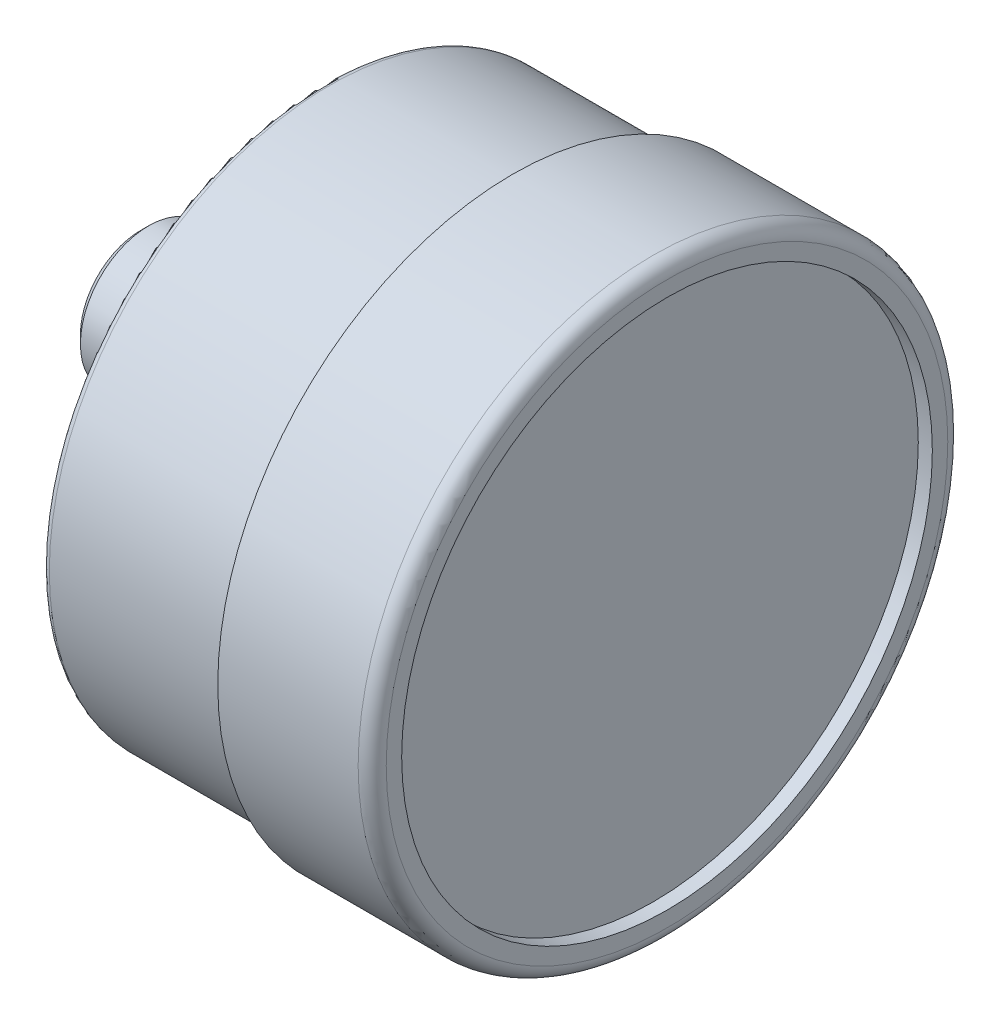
ISO-10303-21;
HEADER;
FILE_DESCRIPTION(('STEP AP214'),'2;1');
FILE_NAME('part.step','',(''),(''),'','','');
FILE_SCHEMA(('AUTOMOTIVE_DESIGN { 1 0 10303 214 1 1 1 1 }'));
ENDSEC;
DATA;
#1=APPLICATION_CONTEXT('core data for automotive mechanical design processes');
#2=APPLICATION_PROTOCOL_DEFINITION('international standard','automotive_design',2000,#1);
#3=PRODUCT_CONTEXT('',#1,'mechanical');
#4=PRODUCT('Part','Part','',(#3));
#5=PRODUCT_RELATED_PRODUCT_CATEGORY('part','',(#4));
#6=PRODUCT_DEFINITION_FORMATION('','',#4);
#7=PRODUCT_DEFINITION_CONTEXT('part definition',#1,'design');
#8=PRODUCT_DEFINITION('design','',#6,#7);
#9=PRODUCT_DEFINITION_SHAPE('','',#8);
#10=(LENGTH_UNIT() NAMED_UNIT(*) SI_UNIT(.MILLI.,.METRE.));
#11=(NAMED_UNIT(*) PLANE_ANGLE_UNIT() SI_UNIT($,.RADIAN.));
#12=(NAMED_UNIT(*) SI_UNIT($,.STERADIAN.) SOLID_ANGLE_UNIT());
#13=UNCERTAINTY_MEASURE_WITH_UNIT(LENGTH_MEASURE(1.E-05),#10,'distance_accuracy_value','');
#14=(GEOMETRIC_REPRESENTATION_CONTEXT(3) GLOBAL_UNCERTAINTY_ASSIGNED_CONTEXT((#13)) GLOBAL_UNIT_ASSIGNED_CONTEXT((#10,
#11,#12)) REPRESENTATION_CONTEXT('',''));
#15=CARTESIAN_POINT('',(0.,0.,0.));
#16=DIRECTION('',(0.,0.,1.));
#17=DIRECTION('',(1.,0.,0.));
#18=AXIS2_PLACEMENT_3D('',#15,#16,#17);
#19=CARTESIAN_POINT('',(0.,4.864,0.));
#20=DIRECTION('',(1.,0.,0.));
#21=DIRECTION('',(0.,0.,-1.));
#22=AXIS2_PLACEMENT_3D('',#19,#20,#21);
#23=PLANE('',#22);
#24=CARTESIAN_POINT('',(0.,0.,0.));
#25=DIRECTION('',(-1.,0.,0.));
#26=DIRECTION('',(0.,0.,1.));
#27=AXIS2_PLACEMENT_3D('',#24,#25,#26);
#28=CIRCLE('',#27,19.5);
#29=CARTESIAN_POINT('',(0.,0.,19.5));
#30=VERTEX_POINT('',#29);
#31=EDGE_CURVE('E177',#30,#30,#28,.T.);
#32=ORIENTED_EDGE('',*,*,#31,.T.);
#33=EDGE_LOOP('',(#32));
#34=FACE_BOUND('',#33,.T.);
#35=DIRECTION('',(0.,-1.,0.));
#36=VECTOR('',#35,1.);
#37=CARTESIAN_POINT('',(0.,4.864,4.864));
#38=LINE('',#37,#36);
#39=CARTESIAN_POINT('',(0.,4.864,4.864));
#40=VERTEX_POINT('',#39);
#41=CARTESIAN_POINT('',(0.,-4.864,4.864));
#42=VERTEX_POINT('',#41);
#43=EDGE_CURVE('E110',#40,#42,#38,.T.);
#44=ORIENTED_EDGE('',*,*,#43,.T.);
#45=DIRECTION('',(0.,0.,-1.));
#46=VECTOR('',#45,1.);
#47=CARTESIAN_POINT('',(0.,-4.864,4.864));
#48=LINE('',#47,#46);
#49=CARTESIAN_POINT('',(0.,-4.864,-4.864));
#50=VERTEX_POINT('',#49);
#51=EDGE_CURVE('E95',#42,#50,#48,.T.);
#52=ORIENTED_EDGE('',*,*,#51,.T.);
#53=DIRECTION('',(0.,1.,0.));
#54=VECTOR('',#53,1.);
#55=CARTESIAN_POINT('',(0.,-4.864,-4.864));
#56=LINE('',#55,#54);
#57=CARTESIAN_POINT('',(0.,4.864,-4.864));
#58=VERTEX_POINT('',#57);
#59=EDGE_CURVE('E107',#50,#58,#56,.T.);
#60=ORIENTED_EDGE('',*,*,#59,.T.);
#61=DIRECTION('',(0.,0.,1.));
#62=VECTOR('',#61,1.);
#63=CARTESIAN_POINT('',(0.,4.864,-4.864));
#64=LINE('',#63,#62);
#65=EDGE_CURVE('E114',#58,#40,#64,.T.);
#66=ORIENTED_EDGE('',*,*,#65,.T.);
#67=EDGE_LOOP('',(#44,#52,#60,#66));
#68=FACE_BOUND('',#67,.T.);
#69=ADVANCED_FACE('F39',(#34,#68),#23,.F.);
#70=CARTESIAN_POINT('',(0.500000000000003,0.,0.));
#71=DIRECTION('',(-1.,0.,0.));
#72=DIRECTION('',(0.,0.,1.));
#73=AXIS2_PLACEMENT_3D('',#70,#71,#72);
#74=TOROIDAL_SURFACE('',#73,19.5,0.500000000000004);
#75=ORIENTED_EDGE('',*,*,#31,.F.);
#76=EDGE_LOOP('',(#75));
#77=FACE_BOUND('',#76,.T.);
#78=CARTESIAN_POINT('',(0.5,0.,0.));
#79=DIRECTION('',(-1.,0.,0.));
#80=DIRECTION('',(0.,0.,1.));
#81=AXIS2_PLACEMENT_3D('',#78,#79,#80);
#82=CIRCLE('',#81,20.);
#83=CARTESIAN_POINT('',(0.5,0.,20.));
#84=VERTEX_POINT('',#83);
#85=EDGE_CURVE('E174',#84,#84,#82,.T.);
#86=ORIENTED_EDGE('',*,*,#85,.T.);
#87=EDGE_LOOP('',(#86));
#88=FACE_BOUND('',#87,.T.);
#89=ADVANCED_FACE('F214',(#77,#88),#74,.T.);
#90=CARTESIAN_POINT('',(23.5,0.,0.));
#91=DIRECTION('',(-1.,0.,0.));
#92=DIRECTION('',(0.,0.,1.));
#93=AXIS2_PLACEMENT_3D('',#90,#91,#92);
#94=CYLINDRICAL_SURFACE('',#93,20.);
#95=ORIENTED_EDGE('',*,*,#85,.F.);
#96=EDGE_LOOP('',(#95));
#97=FACE_BOUND('',#96,.T.);
#98=CARTESIAN_POINT('',(13.5,0.,0.));
#99=DIRECTION('',(-1.,0.,0.));
#100=DIRECTION('',(0.,0.,1.));
#101=AXIS2_PLACEMENT_3D('',#98,#99,#100);
#102=CIRCLE('',#101,20.);
#103=CARTESIAN_POINT('',(13.5,0.,20.));
#104=VERTEX_POINT('',#103);
#105=EDGE_CURVE('E171',#104,#104,#102,.T.);
#106=ORIENTED_EDGE('',*,*,#105,.T.);
#107=EDGE_LOOP('',(#106));
#108=FACE_BOUND('',#107,.T.);
#109=ADVANCED_FACE('F220',(#97,#108),#94,.T.);
#110=CARTESIAN_POINT('',(13.5,20.,0.));
#111=DIRECTION('',(1.,0.,0.));
#112=DIRECTION('',(0.,0.,-1.));
#113=AXIS2_PLACEMENT_3D('',#110,#111,#112);
#114=PLANE('',#113);
#115=ORIENTED_EDGE('',*,*,#105,.F.);
#116=EDGE_LOOP('',(#115));
#117=FACE_BOUND('',#116,.T.);
#118=CARTESIAN_POINT('',(13.5,0.,0.));
#119=DIRECTION('',(-1.,0.,0.));
#120=DIRECTION('',(0.,0.,1.));
#121=AXIS2_PLACEMENT_3D('',#118,#119,#120);
#122=CIRCLE('',#121,21.);
#123=CARTESIAN_POINT('',(13.5,0.,21.));
#124=VERTEX_POINT('',#123);
#125=EDGE_CURVE('E168',#124,#124,#122,.T.);
#126=ORIENTED_EDGE('',*,*,#125,.T.);
#127=EDGE_LOOP('',(#126));
#128=FACE_BOUND('',#127,.T.);
#129=ADVANCED_FACE('F298',(#117,#128),#114,.F.);
#130=CARTESIAN_POINT('',(23.5,0.,0.));
#131=DIRECTION('',(-1.,0.,0.));
#132=DIRECTION('',(0.,0.,1.));
#133=AXIS2_PLACEMENT_3D('',#130,#131,#132);
#134=CYLINDRICAL_SURFACE('',#133,21.);
#135=ORIENTED_EDGE('',*,*,#125,.F.);
#136=EDGE_LOOP('',(#135));
#137=FACE_BOUND('',#136,.T.);
#138=CARTESIAN_POINT('',(23.5,0.,0.));
#139=DIRECTION('',(-1.,0.,0.));
#140=DIRECTION('',(0.,0.,1.));
#141=AXIS2_PLACEMENT_3D('',#138,#139,#140);
#142=CIRCLE('',#141,21.);
#143=CARTESIAN_POINT('',(23.5,0.,21.));
#144=VERTEX_POINT('',#143);
#145=EDGE_CURVE('E165',#144,#144,#142,.T.);
#146=ORIENTED_EDGE('',*,*,#145,.T.);
#147=EDGE_LOOP('',(#146));
#148=FACE_BOUND('',#147,.T.);
#149=ADVANCED_FACE('F290',(#137,#148),#134,.T.);
#150=CARTESIAN_POINT('',(23.5,0.,0.));
#151=DIRECTION('',(-1.,0.,0.));
#152=DIRECTION('',(0.,0.,1.));
#153=AXIS2_PLACEMENT_3D('',#150,#151,#152);
#154=TOROIDAL_SURFACE('',#153,20.,1.00000000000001);
#155=ORIENTED_EDGE('',*,*,#145,.F.);
#156=EDGE_LOOP('',(#155));
#157=FACE_BOUND('',#156,.T.);
#158=CARTESIAN_POINT('',(24.5,0.,0.));
#159=DIRECTION('',(-1.,0.,0.));
#160=DIRECTION('',(0.,0.,1.));
#161=AXIS2_PLACEMENT_3D('',#158,#159,#160);
#162=CIRCLE('',#161,20.);
#163=CARTESIAN_POINT('',(24.5,0.,20.));
#164=VERTEX_POINT('',#163);
#165=EDGE_CURVE('E162',#164,#164,#162,.T.);
#166=ORIENTED_EDGE('',*,*,#165,.T.);
#167=EDGE_LOOP('',(#166));
#168=FACE_BOUND('',#167,.T.);
#169=ADVANCED_FACE('F281',(#157,#168),#154,.T.);
#170=CARTESIAN_POINT('',(24.5,20.,0.));
#171=DIRECTION('',(-1.,0.,0.));
#172=DIRECTION('',(0.,0.,1.));
#173=AXIS2_PLACEMENT_3D('',#170,#171,#172);
#174=PLANE('',#173);
#175=ORIENTED_EDGE('',*,*,#165,.F.);
#176=EDGE_LOOP('',(#175));
#177=FACE_BOUND('',#176,.T.);
#178=CARTESIAN_POINT('',(24.5,0.,0.));
#179=DIRECTION('',(-1.,0.,0.));
#180=DIRECTION('',(0.,0.,1.));
#181=AXIS2_PLACEMENT_3D('',#178,#179,#180);
#182=CIRCLE('',#181,18.9);
#183=CARTESIAN_POINT('',(24.5,0.,18.9));
#184=VERTEX_POINT('',#183);
#185=EDGE_CURVE('E159',#184,#184,#182,.T.);
#186=ORIENTED_EDGE('',*,*,#185,.T.);
#187=EDGE_LOOP('',(#186));
#188=FACE_BOUND('',#187,.T.);
#189=ADVANCED_FACE('F271',(#177,#188),#174,.F.);
#190=CARTESIAN_POINT('',(23.5,0.,0.));
#191=DIRECTION('',(-1.,0.,0.));
#192=DIRECTION('',(0.,0.,1.));
#193=AXIS2_PLACEMENT_3D('',#190,#191,#192);
#194=CYLINDRICAL_SURFACE('',#193,18.9);
#195=ORIENTED_EDGE('',*,*,#185,.F.);
#196=EDGE_LOOP('',(#195));
#197=FACE_BOUND('',#196,.T.);
#198=CARTESIAN_POINT('',(23.5,0.,0.));
#199=DIRECTION('',(-1.,0.,0.));
#200=DIRECTION('',(0.,0.,1.));
#201=AXIS2_PLACEMENT_3D('',#198,#199,#200);
#202=CIRCLE('',#201,18.9);
#203=CARTESIAN_POINT('',(23.5,0.,18.9));
#204=VERTEX_POINT('',#203);
#205=EDGE_CURVE('E156',#204,#204,#202,.T.);
#206=ORIENTED_EDGE('',*,*,#205,.T.);
#207=EDGE_LOOP('',(#206));
#208=FACE_BOUND('',#207,.T.);
#209=ADVANCED_FACE('F264',(#197,#208),#194,.F.);
#210=CARTESIAN_POINT('',(23.5,18.9,0.));
#211=DIRECTION('',(-1.,0.,0.));
#212=DIRECTION('',(0.,0.,1.));
#213=AXIS2_PLACEMENT_3D('',#210,#211,#212);
#214=PLANE('',#213);
#215=ORIENTED_EDGE('',*,*,#205,.F.);
#216=EDGE_LOOP('',(#215));
#217=FACE_BOUND('',#216,.T.);
#218=ADVANCED_FACE('F146',(#217),#214,.F.);
#219=CARTESIAN_POINT('',(-18.75,4.864,4.864));
#220=DIRECTION('',(0.,0.,1.));
#221=DIRECTION('',(1.,0.,0.));
#222=AXIS2_PLACEMENT_3D('',#219,#220,#221);
#223=PLANE('',#222);
#224=CARTESIAN_POINT('',(-6.50000000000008,0.,4.864));
#225=CARTESIAN_POINT('',(-6.50000229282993,-0.30646331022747,4.864));
#226=CARTESIAN_POINT('',(-6.48620933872,-0.61291934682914,4.864));
#227=CARTESIAN_POINT('',(-6.43192815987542,-1.2234422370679,4.864));
#228=CARTESIAN_POINT('',(-6.39143778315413,-1.52750889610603,4.864));
#229=CARTESIAN_POINT('',(-6.2857638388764,-2.13229253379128,4.864));
#230=CARTESIAN_POINT('',(-6.2204996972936,-2.43299525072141,4.864));
#231=CARTESIAN_POINT('',(-6.0678653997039,-3.02872195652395,4.864));
#232=CARTESIAN_POINT('',(-5.9804911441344,-3.32374488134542,4.864));
#233=CARTESIAN_POINT('',(-5.74553132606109,-4.02857535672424,4.864));
#234=CARTESIAN_POINT('',(-5.58801769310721,-4.43508626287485,4.864));
#235=CARTESIAN_POINT('',(-5.23859299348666,-5.23304949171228,4.864));
#236=CARTESIAN_POINT('',(-5.04666963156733,-5.62449637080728,4.864));
#237=CARTESIAN_POINT('',(-4.63204995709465,-6.39092012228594,4.864));
#238=CARTESIAN_POINT('',(-4.40933983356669,-6.76588950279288,4.864));
#239=CARTESIAN_POINT('',(-3.93604689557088,-7.49769020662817,4.864));
#240=CARTESIAN_POINT('',(-3.6854675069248,-7.85452375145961,4.864));
#241=CARTESIAN_POINT('',(-3.15214448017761,-8.55735451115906,4.864));
#242=CARTESIAN_POINT('',(-2.86875655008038,-8.90286245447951,4.864));
#243=CARTESIAN_POINT('',(-2.27722498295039,-9.57199999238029,4.864));
#244=CARTESIAN_POINT('',(-1.96908005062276,-9.8956284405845,4.864));
#245=CARTESIAN_POINT('',(-1.33016893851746,-10.5194956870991,4.864));
#246=CARTESIAN_POINT('',(-0.999410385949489,-10.8197422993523,4.864));
#247=CARTESIAN_POINT('',(-0.317263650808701,-11.3955523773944,4.864));
#248=CARTESIAN_POINT('',(0.0341181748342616,-11.671123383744,4.864));
#249=CARTESIAN_POINT('',(0.810688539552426,-12.2365294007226,4.864));
#250=CARTESIAN_POINT('',(1.23896382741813,-12.5221373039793,4.864));
#251=CARTESIAN_POINT('',(2.11745264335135,-13.0573920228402,4.864));
#252=CARTESIAN_POINT('',(2.56766820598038,-13.3070354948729,4.864));
#253=CARTESIAN_POINT('',(3.48720249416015,-13.7689770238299,4.864));
#254=CARTESIAN_POINT('',(3.95653234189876,-13.9812529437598,4.864));
#255=CARTESIAN_POINT('',(4.91087760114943,-14.3669864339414,4.864));
#256=CARTESIAN_POINT('',(5.39589315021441,-14.540443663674,4.864));
#257=CARTESIAN_POINT('',(6.39449652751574,-14.8525151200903,4.864));
#258=CARTESIAN_POINT('',(6.90849983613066,-14.989801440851,4.864));
#259=CARTESIAN_POINT('',(7.94618911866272,-15.2209435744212,4.864));
#260=CARTESIAN_POINT('',(8.46987535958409,-15.3147981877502,4.864));
#261=CARTESIAN_POINT('',(9.52321839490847,-15.4584545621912,4.864));
#262=CARTESIAN_POINT('',(10.0528747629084,-15.5082594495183,4.864));
#263=CARTESIAN_POINT('',(11.1144936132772,-15.563501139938,4.864));
#264=CARTESIAN_POINT('',(11.6464560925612,-15.5689380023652,4.864));
#265=CARTESIAN_POINT('',(12.7136248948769,-15.5352611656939,4.864));
#266=CARTESIAN_POINT('',(13.2488189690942,-15.495757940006,4.864));
#267=CARTESIAN_POINT('',(14.3139850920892,-15.3718305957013,4.864));
#268=CARTESIAN_POINT('',(14.8439570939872,-15.2874060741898,4.864));
#269=CARTESIAN_POINT('',(15.8949410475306,-15.0741904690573,4.864));
#270=CARTESIAN_POINT('',(16.4159523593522,-14.9453962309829,4.864));
#271=CARTESIAN_POINT('',(17.4452473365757,-14.6442988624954,4.864));
#272=CARTESIAN_POINT('',(17.9535310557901,-14.4719959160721,4.864));
#273=CARTESIAN_POINT('',(18.9535027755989,-14.0851025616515,4.864));
#274=CARTESIAN_POINT('',(19.4451975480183,-13.8705296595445,4.864));
#275=CARTESIAN_POINT('',(20.4086336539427,-13.400462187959,4.864));
#276=CARTESIAN_POINT('',(20.8803747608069,-13.1449671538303,4.864));
#277=CARTESIAN_POINT('',(21.800404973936,-12.5947239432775,4.864));
#278=CARTESIAN_POINT('',(22.2486933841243,-12.2999746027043,4.864));
#279=CARTESIAN_POINT('',(23.1183613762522,-11.6731456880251,4.864));
#280=CARTESIAN_POINT('',(23.5397419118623,-11.3410674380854,4.864));
#281=CARTESIAN_POINT('',(24.3479452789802,-10.6453890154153,4.864));
#282=CARTESIAN_POINT('',(24.7350838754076,-10.282155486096,4.864));
#283=CARTESIAN_POINT('',(25.4764308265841,-9.52341954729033,4.864));
#284=CARTESIAN_POINT('',(25.8306413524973,-9.12791926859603,4.864));
#285=CARTESIAN_POINT('',(26.3346615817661,-8.51226175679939,4.864));
#286=CARTESIAN_POINT('',(26.498186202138,-8.30320938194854,4.864));
#287=CARTESIAN_POINT('',(26.8156017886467,-7.8780004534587,4.864));
#288=CARTESIAN_POINT('',(26.9694949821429,-7.66184556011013,4.864));
#289=CARTESIAN_POINT('',(27.4159769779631,-7.00320155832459,4.864));
#290=CARTESIAN_POINT('',(27.6935431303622,-6.55032006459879,4.864));
#291=CARTESIAN_POINT('',(28.1230450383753,-5.76653844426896,4.864));
#292=CARTESIAN_POINT('',(28.2870112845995,-5.44215660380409,4.864));
#293=CARTESIAN_POINT('',(28.5916895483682,-4.78259191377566,4.864));
#294=CARTESIAN_POINT('',(28.7324033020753,-4.44740987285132,4.864));
#295=CARTESIAN_POINT('',(28.987493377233,-3.76823927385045,4.864));
#296=CARTESIAN_POINT('',(29.1019455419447,-3.42427934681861,4.864));
#297=CARTESIAN_POINT('',(29.3015100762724,-2.72790347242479,4.864));
#298=CARTESIAN_POINT('',(29.3866285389,-2.37548929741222,4.864));
#299=CARTESIAN_POINT('',(29.5122028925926,-1.72225304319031,4.864));
#300=CARTESIAN_POINT('',(29.5576813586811,-1.42240008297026,4.864));
#301=CARTESIAN_POINT('',(29.6229258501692,-0.819931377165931,4.864));
#302=CARTESIAN_POINT('',(29.6426985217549,-0.51731636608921,4.864));
#303=CARTESIAN_POINT('',(29.6553355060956,0.0883701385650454,4.864));
#304=CARTESIAN_POINT('',(29.6482101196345,0.391441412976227,4.864));
#305=CARTESIAN_POINT('',(29.6075303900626,0.995828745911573,4.864));
#306=CARTESIAN_POINT('',(29.5739701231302,1.2971443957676,4.864));
#307=CARTESIAN_POINT('',(29.472468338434,1.95999803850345,4.864));
#308=CARTESIAN_POINT('',(29.3987117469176,2.32064371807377,4.864));
#309=CARTESIAN_POINT('',(29.2193692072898,3.03390689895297,4.864));
#310=CARTESIAN_POINT('',(29.1137730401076,3.38652178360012,4.864));
#311=CARTESIAN_POINT('',(28.8743301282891,4.08338649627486,4.864));
#312=CARTESIAN_POINT('',(28.7403822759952,4.42760133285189,4.864));
#313=CARTESIAN_POINT('',(28.4476059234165,5.10520582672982,4.864));
#314=CARTESIAN_POINT('',(28.2887771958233,5.43859538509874,4.864));
#315=CARTESIAN_POINT('',(27.8943011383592,6.19819910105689,4.864));
#316=CARTESIAN_POINT('',(27.6503115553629,6.62009673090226,4.864));
#317=CARTESIAN_POINT('',(27.1271870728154,7.44154419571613,4.864));
#318=CARTESIAN_POINT('',(26.848043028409,7.84108817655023,4.864));
#319=CARTESIAN_POINT('',(26.2581794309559,8.61536230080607,4.864));
#320=CARTESIAN_POINT('',(25.9474980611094,8.99012156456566,4.864));
#321=CARTESIAN_POINT('',(25.2970402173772,9.71349692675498,4.864));
#322=CARTESIAN_POINT('',(24.957261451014,10.0621109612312,4.864));
#323=CARTESIAN_POINT('',(24.247672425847,10.7347443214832,4.864));
#324=CARTESIAN_POINT('',(23.8775949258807,11.0584816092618,4.864));
#325=CARTESIAN_POINT('',(23.1130288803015,11.675711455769,4.864));
#326=CARTESIAN_POINT('',(22.7185399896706,11.9692035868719,4.864));
#327=CARTESIAN_POINT('',(21.9076591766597,12.524427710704,4.864));
#328=CARTESIAN_POINT('',(21.4912613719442,12.7861511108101,4.864));
#329=CARTESIAN_POINT('',(20.6393225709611,13.2763133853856,4.864));
#330=CARTESIAN_POINT('',(20.2037813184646,13.5047518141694,4.864));
#331=CARTESIAN_POINT('',(19.2844476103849,13.9422206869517,4.864));
#332=CARTESIAN_POINT('',(18.7994336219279,14.1486888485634,4.864));
#333=CARTESIAN_POINT('',(17.8139231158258,14.5206381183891,4.864));
#334=CARTESIAN_POINT('',(17.3134258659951,14.686117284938,4.864));
#335=CARTESIAN_POINT('',(16.3003761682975,14.9750412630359,4.864));
#336=CARTESIAN_POINT('',(15.787822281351,15.0984810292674,4.864));
#337=CARTESIAN_POINT('',(14.7542601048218,15.3025051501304,4.864));
#338=CARTESIAN_POINT('',(14.2332518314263,15.3830895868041,4.864));
#339=CARTESIAN_POINT('',(13.1781778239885,15.501805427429,4.864));
#340=CARTESIAN_POINT('',(12.6440352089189,15.5392546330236,4.864));
#341=CARTESIAN_POINT('',(11.5744868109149,15.5691658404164,4.864));
#342=CARTESIAN_POINT('',(11.0390810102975,15.5616272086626,4.864));
#343=CARTESIAN_POINT('',(9.9707614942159,15.5016100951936,4.864));
#344=CARTESIAN_POINT('',(9.43784792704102,15.4491289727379,4.864));
#345=CARTESIAN_POINT('',(8.37831642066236,15.2995717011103,4.864));
#346=CARTESIAN_POINT('',(7.85169846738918,15.2024956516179,4.864));
#347=CARTESIAN_POINT('',(6.80697845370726,14.9640459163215,4.864));
#348=CARTESIAN_POINT('',(6.28890551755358,14.8225445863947,4.864));
#349=CARTESIAN_POINT('',(5.26656154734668,14.4962739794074,4.864));
#350=CARTESIAN_POINT('',(4.76229062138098,14.3115043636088,4.864));
#351=CARTESIAN_POINT('',(3.77122183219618,13.8999293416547,4.864));
#352=CARTESIAN_POINT('',(3.28442336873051,13.6731253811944,4.864));
#353=CARTESIAN_POINT('',(2.33186086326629,13.1789761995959,4.864));
#354=CARTESIAN_POINT('',(1.86609646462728,12.9116316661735,4.864));
#355=CARTESIAN_POINT('',(0.961532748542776,12.3396964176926,4.864));
#356=CARTESIAN_POINT('',(0.522601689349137,12.0353141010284,4.864));
#357=CARTESIAN_POINT('',(-0.327850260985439,11.3899608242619,4.864));
#358=CARTESIAN_POINT('',(-0.739357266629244,11.0489715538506,4.864));
#359=CARTESIAN_POINT('',(-1.53133470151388,10.3327250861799,4.864));
#360=CARTESIAN_POINT('',(-1.91180753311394,9.95747054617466,4.864));
#361=CARTESIAN_POINT('',(-2.63832902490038,9.17502226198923,4.864));
#362=CARTESIAN_POINT('',(-2.98438265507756,8.76783314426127,4.864));
#363=CARTESIAN_POINT('',(-3.57924101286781,8.00038944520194,4.864));
#364=CARTESIAN_POINT('',(-3.83431186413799,7.64497556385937,4.864));
#365=CARTESIAN_POINT('',(-4.3167208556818,6.91573053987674,4.864));
#366=CARTESIAN_POINT('',(-4.54405867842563,6.54189918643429,4.864));
#367=CARTESIAN_POINT('',(-4.96813215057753,5.77747866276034,4.864));
#368=CARTESIAN_POINT('',(-5.16488353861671,5.38689824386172,4.864));
#369=CARTESIAN_POINT('',(-5.52431279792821,4.5903415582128,4.864));
#370=CARTESIAN_POINT('',(-5.68700022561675,4.18436964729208,4.864));
#371=CARTESIAN_POINT('',(-5.93541667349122,3.46803814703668,4.864));
#372=CARTESIAN_POINT('',(-6.03012016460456,3.16078280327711,4.864));
#373=CARTESIAN_POINT('',(-6.19575264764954,2.5399054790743,4.864));
#374=CARTESIAN_POINT('',(-6.26668581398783,2.22628462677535,4.864));
#375=CARTESIAN_POINT('',(-6.38164784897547,1.59522367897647,4.864));
#376=CARTESIAN_POINT('',(-6.42577042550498,1.27780088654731,4.864));
#377=CARTESIAN_POINT('',(-6.48494301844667,0.640249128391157,4.864));
#378=CARTESIAN_POINT('',(-6.49999760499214,0.32012059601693,4.864));
#379=CARTESIAN_POINT('',(-6.50000000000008,0.,4.864));
#380=B_SPLINE_CURVE_WITH_KNOTS('',3,(#224,#225,#226,#227,#228,#229,#230,#231,#232,#233,#234,
#235,#236,#237,#238,#239,#240,#241,#242,#243,#244,#245,#246,#247,#248,#249,#250,#251,#252,#253,
#254,#255,#256,#257,#258,#259,#260,#261,#262,#263,#264,#265,#266,#267,#268,#269,#270,#271,#272,
#273,#274,#275,#276,#277,#278,#279,#280,#281,#282,#283,#284,#285,#286,#287,#288,#289,#290,#291,
#292,#293,#294,#295,#296,#297,#298,#299,#300,#301,#302,#303,#304,#305,#306,#307,#308,#309,#310,
#311,#312,#313,#314,#315,#316,#317,#318,#319,#320,#321,#322,#323,#324,#325,#326,#327,#328,#329,
#330,#331,#332,#333,#334,#335,#336,#337,#338,#339,#340,#341,#342,#343,#344,#345,#346,#347,#348,
#349,#350,#351,#352,#353,#354,#355,#356,#357,#358,#359,#360,#361,#362,#363,#364,#365,#366,#367,
#368,#369,#370,#371,#372,#373,#374,#375,#376,#377,#378,#379),.UNSPECIFIED.,.T.,.F.,(4,2,2,2,2,2,
2,2,2,2,2,2,2,2,2,2,2,2,2,2,2,2,2,2,2,2,2,2,2,2,2,2,2,2,2,2,2,2,2,2,2,2,2,2,2,2,2,2,2,2,2,2,2,2,
2,2,2,2,2,2,2,2,2,2,2,2,2,2,2,2,2,2,2,2,2,2,2,4),(0.,0.919080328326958,1.83823474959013,
2.76040459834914,3.68274555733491,4.98872078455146,6.29516359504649,7.6021943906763,
8.9090646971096,10.2483940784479,11.5877935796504,12.9267435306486,14.2652829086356,
15.8078271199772,17.3505146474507,18.8941130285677,20.4377249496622,22.0319153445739,
23.6261497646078,25.2202710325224,26.8143901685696,28.422432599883,30.0304894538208,
31.6386606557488,33.2468250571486,34.8543248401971,36.4618428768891,38.0694085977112,
39.6769173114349,41.2675867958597,42.8581513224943,43.6541471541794,44.4499582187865,
46.0407562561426,47.1304017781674,48.2199659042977,49.3063426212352,50.3924935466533,
51.3013390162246,52.2099494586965,53.1182119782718,54.0266780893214,55.1293024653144,
56.2322811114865,57.3392615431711,58.4462520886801,59.9063866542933,61.3669018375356,
62.8256693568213,64.2845519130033,65.75808009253,67.2316291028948,68.7055757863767,
70.179542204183,71.7590889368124,73.3387104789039,74.9185215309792,76.4983295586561,
78.1027938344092,79.7072807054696,81.3118618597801,82.916439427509,84.5256701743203,
86.1349135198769,87.7441015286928,89.35326224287,90.9537546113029,92.5550512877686,
94.1562238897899,95.757164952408,97.0684005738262,98.3796512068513,99.6902248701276,
101.000430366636,101.964176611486,102.927753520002,103.887942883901,104.847981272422),.UNSPECIFIED.);
#381=CARTESIAN_POINT('',(-6.49999999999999,0.,4.864));
#382=VERTEX_POINT('',#381);
#383=CARTESIAN_POINT('',(-5.40015962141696,-4.864,4.86400000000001));
#384=VERTEX_POINT('',#383);
#385=EDGE_CURVE('E151',#382,#384,#380,.T.);
#386=ORIENTED_EDGE('',*,*,#385,.T.);
#387=DIRECTION('',(1.,0.,0.));
#388=VECTOR('',#387,1.);
#389=CARTESIAN_POINT('',(-18.75,-4.864,4.864));
#390=LINE('',#389,#388);
#391=EDGE_CURVE('E55',#384,#42,#390,.T.);
#392=ORIENTED_EDGE('',*,*,#391,.T.);
#393=ORIENTED_EDGE('',*,*,#43,.F.);
#394=DIRECTION('',(1.,0.,0.));
#395=VECTOR('',#394,1.);
#396=CARTESIAN_POINT('',(-18.75,4.864,4.864));
#397=LINE('',#396,#395);
#398=CARTESIAN_POINT('',(-5.40015962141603,4.864,4.864));
#399=VERTEX_POINT('',#398);
#400=EDGE_CURVE('E119',#399,#40,#397,.T.);
#401=ORIENTED_EDGE('',*,*,#400,.F.);
#402=EDGE_CURVE('E62',#399,#382,#380,.T.);
#403=ORIENTED_EDGE('',*,*,#402,.T.);
#404=EDGE_LOOP('',(#386,#392,#393,#401,#403));
#405=FACE_BOUND('',#404,.T.);
#406=ADVANCED_FACE('F142',(#405),#223,.T.);
#407=CARTESIAN_POINT('',(-18.75,4.864,-4.864));
#408=DIRECTION('',(0.,1.,0.));
#409=DIRECTION('',(0.,0.,1.));
#410=AXIS2_PLACEMENT_3D('',#407,#408,#409);
#411=PLANE('',#410);
#412=CARTESIAN_POINT('',(-6.50000000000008,4.864,0.));
#413=CARTESIAN_POINT('',(-6.50000229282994,4.864,0.30646331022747));
#414=CARTESIAN_POINT('',(-6.48620933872,4.864,0.61291934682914));
#415=CARTESIAN_POINT('',(-6.43192815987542,4.864,1.2234422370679));
#416=CARTESIAN_POINT('',(-6.39143778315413,4.864,1.52750889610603));
#417=CARTESIAN_POINT('',(-6.2857638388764,4.864,2.13229253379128));
#418=CARTESIAN_POINT('',(-6.2204996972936,4.864,2.43299525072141));
#419=CARTESIAN_POINT('',(-6.0678653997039,4.864,3.02872195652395));
#420=CARTESIAN_POINT('',(-5.9804911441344,4.864,3.32374488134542));
#421=CARTESIAN_POINT('',(-5.74553132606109,4.864,4.02857535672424));
#422=CARTESIAN_POINT('',(-5.58801769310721,4.864,4.43508626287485));
#423=CARTESIAN_POINT('',(-5.23859299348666,4.864,5.23304949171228));
#424=CARTESIAN_POINT('',(-5.04666963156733,4.864,5.62449637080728));
#425=CARTESIAN_POINT('',(-4.63204995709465,4.864,6.39092012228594));
#426=CARTESIAN_POINT('',(-4.40933983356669,4.864,6.76588950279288));
#427=CARTESIAN_POINT('',(-3.93604689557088,4.864,7.49769020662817));
#428=CARTESIAN_POINT('',(-3.6854675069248,4.864,7.85452375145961));
#429=CARTESIAN_POINT('',(-3.15214448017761,4.864,8.55735451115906));
#430=CARTESIAN_POINT('',(-2.86875655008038,4.864,8.90286245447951));
#431=CARTESIAN_POINT('',(-2.27722498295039,4.864,9.57199999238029));
#432=CARTESIAN_POINT('',(-1.96908005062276,4.864,9.8956284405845));
#433=CARTESIAN_POINT('',(-1.33016893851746,4.864,10.5194956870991));
#434=CARTESIAN_POINT('',(-0.999410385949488,4.864,10.8197422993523));
#435=CARTESIAN_POINT('',(-0.317263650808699,4.864,11.3955523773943));
#436=CARTESIAN_POINT('',(0.0341181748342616,4.864,11.671123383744));
#437=CARTESIAN_POINT('',(0.810688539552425,4.864,12.2365294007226));
#438=CARTESIAN_POINT('',(1.23896382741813,4.864,12.5221373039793));
#439=CARTESIAN_POINT('',(2.11745264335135,4.864,13.0573920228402));
#440=CARTESIAN_POINT('',(2.56766820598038,4.864,13.3070354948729));
#441=CARTESIAN_POINT('',(3.48720249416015,4.864,13.7689770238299));
#442=CARTESIAN_POINT('',(3.95653234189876,4.864,13.9812529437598));
#443=CARTESIAN_POINT('',(4.91087760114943,4.864,14.3669864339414));
#444=CARTESIAN_POINT('',(5.39589315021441,4.864,14.540443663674));
#445=CARTESIAN_POINT('',(6.39449652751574,4.864,14.8525151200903));
#446=CARTESIAN_POINT('',(6.90849983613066,4.864,14.989801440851));
#447=CARTESIAN_POINT('',(7.94618911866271,4.864,15.2209435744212));
#448=CARTESIAN_POINT('',(8.46987535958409,4.864,15.3147981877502));
#449=CARTESIAN_POINT('',(9.52321839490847,4.864,15.4584545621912));
#450=CARTESIAN_POINT('',(10.0528747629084,4.864,15.5082594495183));
#451=CARTESIAN_POINT('',(11.1144936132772,4.864,15.563501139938));
#452=CARTESIAN_POINT('',(11.6464560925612,4.864,15.5689380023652));
#453=CARTESIAN_POINT('',(12.7136248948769,4.864,15.5352611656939));
#454=CARTESIAN_POINT('',(13.2488189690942,4.864,15.495757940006));
#455=CARTESIAN_POINT('',(14.3139850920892,4.864,15.3718305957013));
#456=CARTESIAN_POINT('',(14.8439570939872,4.864,15.2874060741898));
#457=CARTESIAN_POINT('',(15.8949410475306,4.864,15.0741904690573));
#458=CARTESIAN_POINT('',(16.4159523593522,4.864,14.9453962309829));
#459=CARTESIAN_POINT('',(17.4452473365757,4.864,14.6442988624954));
#460=CARTESIAN_POINT('',(17.9535310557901,4.864,14.4719959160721));
#461=CARTESIAN_POINT('',(18.9535027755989,4.864,14.0851025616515));
#462=CARTESIAN_POINT('',(19.4451975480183,4.864,13.8705296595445));
#463=CARTESIAN_POINT('',(20.4086336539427,4.864,13.400462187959));
#464=CARTESIAN_POINT('',(20.8803747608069,4.864,13.1449671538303));
#465=CARTESIAN_POINT('',(21.800404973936,4.864,12.5947239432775));
#466=CARTESIAN_POINT('',(22.2486933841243,4.864,12.2999746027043));
#467=CARTESIAN_POINT('',(23.1183613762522,4.864,11.6731456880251));
#468=CARTESIAN_POINT('',(23.5397419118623,4.864,11.3410674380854));
#469=CARTESIAN_POINT('',(24.3479452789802,4.864,10.6453890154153));
#470=CARTESIAN_POINT('',(24.7350838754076,4.864,10.282155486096));
#471=CARTESIAN_POINT('',(25.4764308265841,4.864,9.52341954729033));
#472=CARTESIAN_POINT('',(25.8306413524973,4.864,9.12791926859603));
#473=CARTESIAN_POINT('',(26.3346615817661,4.864,8.51226175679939));
#474=CARTESIAN_POINT('',(26.498186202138,4.864,8.30320938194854));
#475=CARTESIAN_POINT('',(26.8156017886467,4.864,7.8780004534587));
#476=CARTESIAN_POINT('',(26.9694949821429,4.864,7.66184556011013));
#477=CARTESIAN_POINT('',(27.4159769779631,4.864,7.00320155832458));
#478=CARTESIAN_POINT('',(27.6935431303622,4.864,6.55032006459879));
#479=CARTESIAN_POINT('',(28.1230450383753,4.864,5.76653844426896));
#480=CARTESIAN_POINT('',(28.2870112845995,4.864,5.44215660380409));
#481=CARTESIAN_POINT('',(28.5916895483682,4.864,4.78259191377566));
#482=CARTESIAN_POINT('',(28.7324033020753,4.864,4.44740987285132));
#483=CARTESIAN_POINT('',(28.987493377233,4.864,3.76823927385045));
#484=CARTESIAN_POINT('',(29.1019455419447,4.864,3.42427934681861));
#485=CARTESIAN_POINT('',(29.3015100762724,4.864,2.72790347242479));
#486=CARTESIAN_POINT('',(29.3866285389,4.864,2.37548929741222));
#487=CARTESIAN_POINT('',(29.5122028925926,4.864,1.72225304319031));
#488=CARTESIAN_POINT('',(29.5576813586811,4.864,1.42240008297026));
#489=CARTESIAN_POINT('',(29.6229258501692,4.864,0.819931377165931));
#490=CARTESIAN_POINT('',(29.6426985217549,4.864,0.51731636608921));
#491=CARTESIAN_POINT('',(29.6553355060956,4.864,-0.0883701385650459));
#492=CARTESIAN_POINT('',(29.6482101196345,4.864,-0.391441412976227));
#493=CARTESIAN_POINT('',(29.6075303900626,4.864,-0.995828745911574));
#494=CARTESIAN_POINT('',(29.5739701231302,4.864,-1.2971443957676));
#495=CARTESIAN_POINT('',(29.472468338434,4.864,-1.95999803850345));
#496=CARTESIAN_POINT('',(29.3987117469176,4.864,-2.32064371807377));
#497=CARTESIAN_POINT('',(29.2193692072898,4.864,-3.03390689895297));
#498=CARTESIAN_POINT('',(29.1137730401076,4.864,-3.38652178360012));
#499=CARTESIAN_POINT('',(28.8743301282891,4.864,-4.08338649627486));
#500=CARTESIAN_POINT('',(28.7403822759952,4.864,-4.42760133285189));
#501=CARTESIAN_POINT('',(28.4476059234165,4.864,-5.10520582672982));
#502=CARTESIAN_POINT('',(28.2887771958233,4.864,-5.43859538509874));
#503=CARTESIAN_POINT('',(27.8943011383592,4.864,-6.19819910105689));
#504=CARTESIAN_POINT('',(27.6503115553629,4.864,-6.62009673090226));
#505=CARTESIAN_POINT('',(27.1271870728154,4.864,-7.44154419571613));
#506=CARTESIAN_POINT('',(26.848043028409,4.864,-7.84108817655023));
#507=CARTESIAN_POINT('',(26.2581794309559,4.864,-8.61536230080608));
#508=CARTESIAN_POINT('',(25.9474980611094,4.864,-8.99012156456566));
#509=CARTESIAN_POINT('',(25.2970402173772,4.864,-9.71349692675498));
#510=CARTESIAN_POINT('',(24.957261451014,4.864,-10.0621109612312));
#511=CARTESIAN_POINT('',(24.247672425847,4.864,-10.7347443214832));
#512=CARTESIAN_POINT('',(23.8775949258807,4.864,-11.0584816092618));
#513=CARTESIAN_POINT('',(23.1130288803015,4.864,-11.675711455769));
#514=CARTESIAN_POINT('',(22.7185399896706,4.864,-11.9692035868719));
#515=CARTESIAN_POINT('',(21.9076591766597,4.864,-12.524427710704));
#516=CARTESIAN_POINT('',(21.4912613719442,4.864,-12.7861511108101));
#517=CARTESIAN_POINT('',(20.6393225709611,4.864,-13.2763133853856));
#518=CARTESIAN_POINT('',(20.2037813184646,4.864,-13.5047518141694));
#519=CARTESIAN_POINT('',(19.2844476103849,4.864,-13.9422206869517));
#520=CARTESIAN_POINT('',(18.7994336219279,4.864,-14.1486888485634));
#521=CARTESIAN_POINT('',(17.8139231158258,4.864,-14.5206381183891));
#522=CARTESIAN_POINT('',(17.3134258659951,4.864,-14.6861172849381));
#523=CARTESIAN_POINT('',(16.3003761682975,4.864,-14.9750412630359));
#524=CARTESIAN_POINT('',(15.7878222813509,4.864,-15.0984810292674));
#525=CARTESIAN_POINT('',(14.7542601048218,4.864,-15.3025051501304));
#526=CARTESIAN_POINT('',(14.2332518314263,4.864,-15.3830895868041));
#527=CARTESIAN_POINT('',(13.1781778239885,4.864,-15.501805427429));
#528=CARTESIAN_POINT('',(12.6440352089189,4.864,-15.5392546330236));
#529=CARTESIAN_POINT('',(11.5744868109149,4.864,-15.5691658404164));
#530=CARTESIAN_POINT('',(11.0390810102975,4.864,-15.5616272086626));
#531=CARTESIAN_POINT('',(9.9707614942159,4.864,-15.5016100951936));
#532=CARTESIAN_POINT('',(9.43784792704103,4.864,-15.4491289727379));
#533=CARTESIAN_POINT('',(8.37831642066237,4.864,-15.2995717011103));
#534=CARTESIAN_POINT('',(7.85169846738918,4.864,-15.2024956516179));
#535=CARTESIAN_POINT('',(6.80697845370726,4.864,-14.9640459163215));
#536=CARTESIAN_POINT('',(6.28890551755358,4.864,-14.8225445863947));
#537=CARTESIAN_POINT('',(5.26656154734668,4.864,-14.4962739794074));
#538=CARTESIAN_POINT('',(4.76229062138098,4.864,-14.3115043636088));
#539=CARTESIAN_POINT('',(3.77122183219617,4.864,-13.8999293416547));
#540=CARTESIAN_POINT('',(3.28442336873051,4.864,-13.6731253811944));
#541=CARTESIAN_POINT('',(2.3318608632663,4.864,-13.1789761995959));
#542=CARTESIAN_POINT('',(1.86609646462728,4.864,-12.9116316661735));
#543=CARTESIAN_POINT('',(0.961532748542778,4.864,-12.3396964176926));
#544=CARTESIAN_POINT('',(0.52260168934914,4.864,-12.0353141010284));
#545=CARTESIAN_POINT('',(-0.327850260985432,4.864,-11.389960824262));
#546=CARTESIAN_POINT('',(-0.739357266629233,4.864,-11.0489715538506));
#547=CARTESIAN_POINT('',(-1.53133470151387,4.864,-10.3327250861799));
#548=CARTESIAN_POINT('',(-1.91180753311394,4.864,-9.95747054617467));
#549=CARTESIAN_POINT('',(-2.63832902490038,4.864,-9.17502226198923));
#550=CARTESIAN_POINT('',(-2.98438265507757,4.864,-8.76783314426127));
#551=CARTESIAN_POINT('',(-3.57924101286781,4.864,-8.00038944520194));
#552=CARTESIAN_POINT('',(-3.83431186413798,4.864,-7.64497556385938));
#553=CARTESIAN_POINT('',(-4.31672085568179,4.864,-6.91573053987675));
#554=CARTESIAN_POINT('',(-4.54405867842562,4.864,-6.54189918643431));
#555=CARTESIAN_POINT('',(-4.96813215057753,4.864,-5.77747866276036));
#556=CARTESIAN_POINT('',(-5.16488353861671,4.864,-5.38689824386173));
#557=CARTESIAN_POINT('',(-5.52431279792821,4.864,-4.5903415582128));
#558=CARTESIAN_POINT('',(-5.68700022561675,4.864,-4.18436964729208));
#559=CARTESIAN_POINT('',(-5.93541667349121,4.864,-3.46803814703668));
#560=CARTESIAN_POINT('',(-6.03012016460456,4.864,-3.1607828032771));
#561=CARTESIAN_POINT('',(-6.19575264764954,4.864,-2.53990547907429));
#562=CARTESIAN_POINT('',(-6.26668581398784,4.864,-2.22628462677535));
#563=CARTESIAN_POINT('',(-6.38164784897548,4.864,-1.59522367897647));
#564=CARTESIAN_POINT('',(-6.42577042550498,4.864,-1.27780088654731));
#565=CARTESIAN_POINT('',(-6.48494301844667,4.864,-0.640249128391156));
#566=CARTESIAN_POINT('',(-6.49999760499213,4.864,-0.32012059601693));
#567=CARTESIAN_POINT('',(-6.50000000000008,4.864,0.));
#568=B_SPLINE_CURVE_WITH_KNOTS('',3,(#412,#413,#414,#415,#416,#417,#418,#419,#420,#421,#422,
#423,#424,#425,#426,#427,#428,#429,#430,#431,#432,#433,#434,#435,#436,#437,#438,#439,#440,#441,
#442,#443,#444,#445,#446,#447,#448,#449,#450,#451,#452,#453,#454,#455,#456,#457,#458,#459,#460,
#461,#462,#463,#464,#465,#466,#467,#468,#469,#470,#471,#472,#473,#474,#475,#476,#477,#478,#479,
#480,#481,#482,#483,#484,#485,#486,#487,#488,#489,#490,#491,#492,#493,#494,#495,#496,#497,#498,
#499,#500,#501,#502,#503,#504,#505,#506,#507,#508,#509,#510,#511,#512,#513,#514,#515,#516,#517,
#518,#519,#520,#521,#522,#523,#524,#525,#526,#527,#528,#529,#530,#531,#532,#533,#534,#535,#536,
#537,#538,#539,#540,#541,#542,#543,#544,#545,#546,#547,#548,#549,#550,#551,#552,#553,#554,#555,
#556,#557,#558,#559,#560,#561,#562,#563,#564,#565,#566,#567),.UNSPECIFIED.,.T.,.F.,(4,2,2,2,2,2,
2,2,2,2,2,2,2,2,2,2,2,2,2,2,2,2,2,2,2,2,2,2,2,2,2,2,2,2,2,2,2,2,2,2,2,2,2,2,2,2,2,2,2,2,2,2,2,2,
2,2,2,2,2,2,2,2,2,2,2,2,2,2,2,2,2,2,2,2,2,2,2,4),(0.,0.919080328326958,1.83823474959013,
2.76040459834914,3.68274555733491,4.98872078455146,6.29516359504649,7.6021943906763,
8.9090646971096,10.2483940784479,11.5877935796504,12.9267435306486,14.2652829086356,
15.8078271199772,17.3505146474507,18.8941130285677,20.4377249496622,22.0319153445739,
23.6261497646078,25.2202710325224,26.8143901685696,28.422432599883,30.0304894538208,
31.6386606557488,33.2468250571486,34.8543248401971,36.4618428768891,38.0694085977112,
39.6769173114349,41.2675867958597,42.8581513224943,43.6541471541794,44.4499582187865,
46.0407562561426,47.1304017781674,48.2199659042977,49.3063426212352,50.3924935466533,
51.3013390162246,52.2099494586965,53.1182119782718,54.0266780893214,55.1293024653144,
56.2322811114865,57.3392615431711,58.4462520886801,59.9063866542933,61.3669018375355,
62.8256693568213,64.2845519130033,65.7580800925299,67.2316291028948,68.7055757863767,
70.1795422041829,71.7590889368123,73.3387104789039,74.9185215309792,76.498329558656,
78.1027938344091,79.7072807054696,81.3118618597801,82.9164394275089,84.5256701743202,
86.1349135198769,87.7441015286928,89.35326224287,90.9537546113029,92.5550512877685,
94.1562238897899,95.757164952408,97.0684005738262,98.3796512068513,99.6902248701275,
101.000430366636,101.964176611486,102.927753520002,103.887942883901,104.847981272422),.UNSPECIFIED.);
#569=CARTESIAN_POINT('',(-6.49999999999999,4.864,0.));
#570=VERTEX_POINT('',#569);
#571=EDGE_CURVE('E152',#570,#399,#568,.T.);
#572=ORIENTED_EDGE('',*,*,#571,.T.);
#573=ORIENTED_EDGE('',*,*,#400,.T.);
#574=ORIENTED_EDGE('',*,*,#65,.F.);
#575=DIRECTION('',(1.,0.,0.));
#576=VECTOR('',#575,1.);
#577=CARTESIAN_POINT('',(-18.75,4.864,-4.864));
#578=LINE('',#577,#576);
#579=CARTESIAN_POINT('',(-5.40015962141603,4.864,-4.864));
#580=VERTEX_POINT('',#579);
#581=EDGE_CURVE('E101',#580,#58,#578,.T.);
#582=ORIENTED_EDGE('',*,*,#581,.F.);
#583=EDGE_CURVE('E153',#580,#570,#568,.T.);
#584=ORIENTED_EDGE('',*,*,#583,.T.);
#585=EDGE_LOOP('',(#572,#573,#574,#582,#584));
#586=FACE_BOUND('',#585,.T.);
#587=ADVANCED_FACE('F145',(#586),#411,.T.);
#588=CARTESIAN_POINT('',(-18.75,-4.864,-4.864));
#589=DIRECTION('',(0.,0.,-1.));
#590=DIRECTION('',(-1.,0.,0.));
#591=AXIS2_PLACEMENT_3D('',#588,#589,#590);
#592=PLANE('',#591);
#593=CARTESIAN_POINT('',(-6.50000000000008,0.,-4.864));
#594=CARTESIAN_POINT('',(-6.50000229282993,0.30646331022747,-4.864));
#595=CARTESIAN_POINT('',(-6.48620933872,0.61291934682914,-4.864));
#596=CARTESIAN_POINT('',(-6.43192815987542,1.2234422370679,-4.864));
#597=CARTESIAN_POINT('',(-6.39143778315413,1.52750889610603,-4.864));
#598=CARTESIAN_POINT('',(-6.2857638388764,2.13229253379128,-4.864));
#599=CARTESIAN_POINT('',(-6.2204996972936,2.43299525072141,-4.864));
#600=CARTESIAN_POINT('',(-6.0678653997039,3.02872195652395,-4.864));
#601=CARTESIAN_POINT('',(-5.9804911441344,3.32374488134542,-4.864));
#602=CARTESIAN_POINT('',(-5.74553132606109,4.02857535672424,-4.864));
#603=CARTESIAN_POINT('',(-5.58801769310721,4.43508626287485,-4.864));
#604=CARTESIAN_POINT('',(-5.23859299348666,5.23304949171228,-4.864));
#605=CARTESIAN_POINT('',(-5.04666963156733,5.62449637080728,-4.864));
#606=CARTESIAN_POINT('',(-4.63204995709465,6.39092012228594,-4.864));
#607=CARTESIAN_POINT('',(-4.40933983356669,6.76588950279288,-4.864));
#608=CARTESIAN_POINT('',(-3.93604689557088,7.49769020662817,-4.864));
#609=CARTESIAN_POINT('',(-3.6854675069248,7.85452375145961,-4.864));
#610=CARTESIAN_POINT('',(-3.15214448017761,8.55735451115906,-4.864));
#611=CARTESIAN_POINT('',(-2.86875655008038,8.90286245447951,-4.864));
#612=CARTESIAN_POINT('',(-2.27722498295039,9.57199999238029,-4.864));
#613=CARTESIAN_POINT('',(-1.96908005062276,9.8956284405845,-4.864));
#614=CARTESIAN_POINT('',(-1.33016893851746,10.5194956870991,-4.864));
#615=CARTESIAN_POINT('',(-0.999410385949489,10.8197422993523,-4.864));
#616=CARTESIAN_POINT('',(-0.317263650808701,11.3955523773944,-4.864));
#617=CARTESIAN_POINT('',(0.0341181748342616,11.671123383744,-4.864));
#618=CARTESIAN_POINT('',(0.810688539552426,12.2365294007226,-4.864));
#619=CARTESIAN_POINT('',(1.23896382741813,12.5221373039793,-4.864));
#620=CARTESIAN_POINT('',(2.11745264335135,13.0573920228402,-4.864));
#621=CARTESIAN_POINT('',(2.56766820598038,13.3070354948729,-4.864));
#622=CARTESIAN_POINT('',(3.48720249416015,13.7689770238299,-4.864));
#623=CARTESIAN_POINT('',(3.95653234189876,13.9812529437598,-4.864));
#624=CARTESIAN_POINT('',(4.91087760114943,14.3669864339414,-4.864));
#625=CARTESIAN_POINT('',(5.39589315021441,14.540443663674,-4.864));
#626=CARTESIAN_POINT('',(6.39449652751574,14.8525151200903,-4.864));
#627=CARTESIAN_POINT('',(6.90849983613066,14.989801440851,-4.864));
#628=CARTESIAN_POINT('',(7.94618911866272,15.2209435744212,-4.864));
#629=CARTESIAN_POINT('',(8.46987535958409,15.3147981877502,-4.864));
#630=CARTESIAN_POINT('',(9.52321839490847,15.4584545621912,-4.864));
#631=CARTESIAN_POINT('',(10.0528747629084,15.5082594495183,-4.864));
#632=CARTESIAN_POINT('',(11.1144936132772,15.563501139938,-4.864));
#633=CARTESIAN_POINT('',(11.6464560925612,15.5689380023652,-4.864));
#634=CARTESIAN_POINT('',(12.7136248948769,15.5352611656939,-4.864));
#635=CARTESIAN_POINT('',(13.2488189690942,15.495757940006,-4.864));
#636=CARTESIAN_POINT('',(14.3139850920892,15.3718305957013,-4.864));
#637=CARTESIAN_POINT('',(14.8439570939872,15.2874060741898,-4.864));
#638=CARTESIAN_POINT('',(15.8949410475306,15.0741904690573,-4.864));
#639=CARTESIAN_POINT('',(16.4159523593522,14.9453962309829,-4.864));
#640=CARTESIAN_POINT('',(17.4452473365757,14.6442988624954,-4.864));
#641=CARTESIAN_POINT('',(17.9535310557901,14.4719959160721,-4.864));
#642=CARTESIAN_POINT('',(18.9535027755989,14.0851025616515,-4.864));
#643=CARTESIAN_POINT('',(19.4451975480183,13.8705296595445,-4.864));
#644=CARTESIAN_POINT('',(20.4086336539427,13.400462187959,-4.864));
#645=CARTESIAN_POINT('',(20.8803747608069,13.1449671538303,-4.864));
#646=CARTESIAN_POINT('',(21.800404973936,12.5947239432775,-4.864));
#647=CARTESIAN_POINT('',(22.2486933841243,12.2999746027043,-4.864));
#648=CARTESIAN_POINT('',(23.1183613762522,11.6731456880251,-4.864));
#649=CARTESIAN_POINT('',(23.5397419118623,11.3410674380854,-4.864));
#650=CARTESIAN_POINT('',(24.3479452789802,10.6453890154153,-4.864));
#651=CARTESIAN_POINT('',(24.7350838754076,10.282155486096,-4.864));
#652=CARTESIAN_POINT('',(25.4764308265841,9.52341954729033,-4.864));
#653=CARTESIAN_POINT('',(25.8306413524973,9.12791926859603,-4.864));
#654=CARTESIAN_POINT('',(26.3346615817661,8.51226175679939,-4.864));
#655=CARTESIAN_POINT('',(26.498186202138,8.30320938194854,-4.864));
#656=CARTESIAN_POINT('',(26.8156017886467,7.8780004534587,-4.864));
#657=CARTESIAN_POINT('',(26.9694949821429,7.66184556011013,-4.864));
#658=CARTESIAN_POINT('',(27.4159769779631,7.00320155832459,-4.864));
#659=CARTESIAN_POINT('',(27.6935431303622,6.55032006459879,-4.864));
#660=CARTESIAN_POINT('',(28.1230450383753,5.76653844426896,-4.864));
#661=CARTESIAN_POINT('',(28.2870112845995,5.44215660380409,-4.864));
#662=CARTESIAN_POINT('',(28.5916895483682,4.78259191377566,-4.864));
#663=CARTESIAN_POINT('',(28.7324033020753,4.44740987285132,-4.864));
#664=CARTESIAN_POINT('',(28.987493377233,3.76823927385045,-4.864));
#665=CARTESIAN_POINT('',(29.1019455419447,3.42427934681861,-4.864));
#666=CARTESIAN_POINT('',(29.3015100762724,2.72790347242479,-4.864));
#667=CARTESIAN_POINT('',(29.3866285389,2.37548929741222,-4.864));
#668=CARTESIAN_POINT('',(29.5122028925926,1.72225304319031,-4.864));
#669=CARTESIAN_POINT('',(29.5576813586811,1.42240008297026,-4.864));
#670=CARTESIAN_POINT('',(29.6229258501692,0.819931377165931,-4.864));
#671=CARTESIAN_POINT('',(29.6426985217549,0.51731636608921,-4.864));
#672=CARTESIAN_POINT('',(29.6553355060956,-0.0883701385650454,-4.864));
#673=CARTESIAN_POINT('',(29.6482101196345,-0.391441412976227,-4.864));
#674=CARTESIAN_POINT('',(29.6075303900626,-0.995828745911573,-4.864));
#675=CARTESIAN_POINT('',(29.5739701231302,-1.2971443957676,-4.864));
#676=CARTESIAN_POINT('',(29.472468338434,-1.95999803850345,-4.864));
#677=CARTESIAN_POINT('',(29.3987117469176,-2.32064371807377,-4.864));
#678=CARTESIAN_POINT('',(29.2193692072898,-3.03390689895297,-4.864));
#679=CARTESIAN_POINT('',(29.1137730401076,-3.38652178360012,-4.864));
#680=CARTESIAN_POINT('',(28.8743301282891,-4.08338649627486,-4.864));
#681=CARTESIAN_POINT('',(28.7403822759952,-4.42760133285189,-4.864));
#682=CARTESIAN_POINT('',(28.4476059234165,-5.10520582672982,-4.864));
#683=CARTESIAN_POINT('',(28.2887771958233,-5.43859538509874,-4.864));
#684=CARTESIAN_POINT('',(27.8943011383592,-6.19819910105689,-4.864));
#685=CARTESIAN_POINT('',(27.6503115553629,-6.62009673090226,-4.864));
#686=CARTESIAN_POINT('',(27.1271870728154,-7.44154419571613,-4.864));
#687=CARTESIAN_POINT('',(26.848043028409,-7.84108817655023,-4.864));
#688=CARTESIAN_POINT('',(26.2581794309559,-8.61536230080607,-4.864));
#689=CARTESIAN_POINT('',(25.9474980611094,-8.99012156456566,-4.864));
#690=CARTESIAN_POINT('',(25.2970402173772,-9.71349692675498,-4.864));
#691=CARTESIAN_POINT('',(24.957261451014,-10.0621109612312,-4.864));
#692=CARTESIAN_POINT('',(24.247672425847,-10.7347443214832,-4.864));
#693=CARTESIAN_POINT('',(23.8775949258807,-11.0584816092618,-4.864));
#694=CARTESIAN_POINT('',(23.1130288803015,-11.675711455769,-4.864));
#695=CARTESIAN_POINT('',(22.7185399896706,-11.9692035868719,-4.864));
#696=CARTESIAN_POINT('',(21.9076591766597,-12.524427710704,-4.864));
#697=CARTESIAN_POINT('',(21.4912613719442,-12.7861511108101,-4.864));
#698=CARTESIAN_POINT('',(20.6393225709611,-13.2763133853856,-4.864));
#699=CARTESIAN_POINT('',(20.2037813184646,-13.5047518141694,-4.864));
#700=CARTESIAN_POINT('',(19.2844476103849,-13.9422206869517,-4.864));
#701=CARTESIAN_POINT('',(18.7994336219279,-14.1486888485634,-4.864));
#702=CARTESIAN_POINT('',(17.8139231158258,-14.5206381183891,-4.864));
#703=CARTESIAN_POINT('',(17.3134258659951,-14.686117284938,-4.864));
#704=CARTESIAN_POINT('',(16.3003761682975,-14.9750412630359,-4.864));
#705=CARTESIAN_POINT('',(15.787822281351,-15.0984810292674,-4.864));
#706=CARTESIAN_POINT('',(14.7542601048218,-15.3025051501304,-4.864));
#707=CARTESIAN_POINT('',(14.2332518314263,-15.3830895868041,-4.864));
#708=CARTESIAN_POINT('',(13.1781778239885,-15.501805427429,-4.864));
#709=CARTESIAN_POINT('',(12.6440352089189,-15.5392546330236,-4.864));
#710=CARTESIAN_POINT('',(11.5744868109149,-15.5691658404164,-4.864));
#711=CARTESIAN_POINT('',(11.0390810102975,-15.5616272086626,-4.864));
#712=CARTESIAN_POINT('',(9.9707614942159,-15.5016100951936,-4.864));
#713=CARTESIAN_POINT('',(9.43784792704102,-15.4491289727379,-4.864));
#714=CARTESIAN_POINT('',(8.37831642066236,-15.2995717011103,-4.864));
#715=CARTESIAN_POINT('',(7.85169846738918,-15.2024956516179,-4.864));
#716=CARTESIAN_POINT('',(6.80697845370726,-14.9640459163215,-4.864));
#717=CARTESIAN_POINT('',(6.28890551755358,-14.8225445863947,-4.864));
#718=CARTESIAN_POINT('',(5.26656154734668,-14.4962739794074,-4.864));
#719=CARTESIAN_POINT('',(4.76229062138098,-14.3115043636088,-4.864));
#720=CARTESIAN_POINT('',(3.77122183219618,-13.8999293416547,-4.864));
#721=CARTESIAN_POINT('',(3.28442336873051,-13.6731253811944,-4.864));
#722=CARTESIAN_POINT('',(2.33186086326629,-13.1789761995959,-4.864));
#723=CARTESIAN_POINT('',(1.86609646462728,-12.9116316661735,-4.864));
#724=CARTESIAN_POINT('',(0.961532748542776,-12.3396964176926,-4.864));
#725=CARTESIAN_POINT('',(0.522601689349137,-12.0353141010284,-4.864));
#726=CARTESIAN_POINT('',(-0.327850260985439,-11.3899608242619,-4.864));
#727=CARTESIAN_POINT('',(-0.739357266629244,-11.0489715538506,-4.864));
#728=CARTESIAN_POINT('',(-1.53133470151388,-10.3327250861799,-4.864));
#729=CARTESIAN_POINT('',(-1.91180753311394,-9.95747054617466,-4.864));
#730=CARTESIAN_POINT('',(-2.63832902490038,-9.17502226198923,-4.864));
#731=CARTESIAN_POINT('',(-2.98438265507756,-8.76783314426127,-4.864));
#732=CARTESIAN_POINT('',(-3.57924101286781,-8.00038944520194,-4.864));
#733=CARTESIAN_POINT('',(-3.83431186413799,-7.64497556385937,-4.864));
#734=CARTESIAN_POINT('',(-4.3167208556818,-6.91573053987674,-4.864));
#735=CARTESIAN_POINT('',(-4.54405867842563,-6.54189918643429,-4.864));
#736=CARTESIAN_POINT('',(-4.96813215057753,-5.77747866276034,-4.864));
#737=CARTESIAN_POINT('',(-5.16488353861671,-5.38689824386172,-4.864));
#738=CARTESIAN_POINT('',(-5.52431279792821,-4.5903415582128,-4.864));
#739=CARTESIAN_POINT('',(-5.68700022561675,-4.18436964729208,-4.864));
#740=CARTESIAN_POINT('',(-5.93541667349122,-3.46803814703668,-4.864));
#741=CARTESIAN_POINT('',(-6.03012016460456,-3.16078280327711,-4.864));
#742=CARTESIAN_POINT('',(-6.19575264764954,-2.5399054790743,-4.864));
#743=CARTESIAN_POINT('',(-6.26668581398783,-2.22628462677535,-4.864));
#744=CARTESIAN_POINT('',(-6.38164784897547,-1.59522367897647,-4.864));
#745=CARTESIAN_POINT('',(-6.42577042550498,-1.27780088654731,-4.864));
#746=CARTESIAN_POINT('',(-6.48494301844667,-0.640249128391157,-4.864));
#747=CARTESIAN_POINT('',(-6.49999760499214,-0.32012059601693,-4.864));
#748=CARTESIAN_POINT('',(-6.50000000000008,0.,-4.864));
#749=B_SPLINE_CURVE_WITH_KNOTS('',3,(#593,#594,#595,#596,#597,#598,#599,#600,#601,#602,#603,
#604,#605,#606,#607,#608,#609,#610,#611,#612,#613,#614,#615,#616,#617,#618,#619,#620,#621,#622,
#623,#624,#625,#626,#627,#628,#629,#630,#631,#632,#633,#634,#635,#636,#637,#638,#639,#640,#641,
#642,#643,#644,#645,#646,#647,#648,#649,#650,#651,#652,#653,#654,#655,#656,#657,#658,#659,#660,
#661,#662,#663,#664,#665,#666,#667,#668,#669,#670,#671,#672,#673,#674,#675,#676,#677,#678,#679,
#680,#681,#682,#683,#684,#685,#686,#687,#688,#689,#690,#691,#692,#693,#694,#695,#696,#697,#698,
#699,#700,#701,#702,#703,#704,#705,#706,#707,#708,#709,#710,#711,#712,#713,#714,#715,#716,#717,
#718,#719,#720,#721,#722,#723,#724,#725,#726,#727,#728,#729,#730,#731,#732,#733,#734,#735,#736,
#737,#738,#739,#740,#741,#742,#743,#744,#745,#746,#747,#748),.UNSPECIFIED.,.T.,.F.,(4,2,2,2,2,2,
2,2,2,2,2,2,2,2,2,2,2,2,2,2,2,2,2,2,2,2,2,2,2,2,2,2,2,2,2,2,2,2,2,2,2,2,2,2,2,2,2,2,2,2,2,2,2,2,
2,2,2,2,2,2,2,2,2,2,2,2,2,2,2,2,2,2,2,2,2,2,2,4),(0.,0.919080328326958,1.83823474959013,
2.76040459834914,3.68274555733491,4.98872078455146,6.29516359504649,7.6021943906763,
8.9090646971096,10.2483940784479,11.5877935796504,12.9267435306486,14.2652829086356,
15.8078271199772,17.3505146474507,18.8941130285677,20.4377249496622,22.0319153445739,
23.6261497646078,25.2202710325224,26.8143901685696,28.422432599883,30.0304894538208,
31.6386606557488,33.2468250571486,34.8543248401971,36.4618428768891,38.0694085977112,
39.6769173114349,41.2675867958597,42.8581513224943,43.6541471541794,44.4499582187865,
46.0407562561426,47.1304017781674,48.2199659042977,49.3063426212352,50.3924935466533,
51.3013390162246,52.2099494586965,53.1182119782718,54.0266780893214,55.1293024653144,
56.2322811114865,57.3392615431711,58.4462520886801,59.9063866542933,61.3669018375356,
62.8256693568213,64.2845519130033,65.75808009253,67.2316291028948,68.7055757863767,
70.179542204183,71.7590889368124,73.3387104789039,74.9185215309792,76.4983295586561,
78.1027938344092,79.7072807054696,81.3118618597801,82.916439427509,84.5256701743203,
86.1349135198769,87.7441015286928,89.35326224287,90.9537546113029,92.5550512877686,
94.1562238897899,95.757164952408,97.0684005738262,98.3796512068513,99.6902248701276,
101.000430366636,101.964176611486,102.927753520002,103.887942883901,104.847981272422),.UNSPECIFIED.);
#750=CARTESIAN_POINT('',(-6.49999999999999,0.,-4.864));
#751=VERTEX_POINT('',#750);
#752=EDGE_CURVE('E206',#751,#580,#749,.T.);
#753=ORIENTED_EDGE('',*,*,#752,.T.);
#754=ORIENTED_EDGE('',*,*,#581,.T.);
#755=ORIENTED_EDGE('',*,*,#59,.F.);
#756=DIRECTION('',(1.,0.,0.));
#757=VECTOR('',#756,1.);
#758=CARTESIAN_POINT('',(-18.75,-4.864,-4.864));
#759=LINE('',#758,#757);
#760=CARTESIAN_POINT('',(-5.40015962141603,-4.864,-4.864));
#761=VERTEX_POINT('',#760);
#762=EDGE_CURVE('E92',#761,#50,#759,.T.);
#763=ORIENTED_EDGE('',*,*,#762,.F.);
#764=EDGE_CURVE('E129',#761,#751,#749,.T.);
#765=ORIENTED_EDGE('',*,*,#764,.T.);
#766=EDGE_LOOP('',(#753,#754,#755,#763,#765));
#767=FACE_BOUND('',#766,.T.);
#768=ADVANCED_FACE('F112',(#767),#592,.T.);
#769=CARTESIAN_POINT('',(-18.75,-4.864,4.864));
#770=DIRECTION('',(0.,-1.,0.));
#771=DIRECTION('',(0.,0.,-1.));
#772=AXIS2_PLACEMENT_3D('',#769,#770,#771);
#773=PLANE('',#772);
#774=CARTESIAN_POINT('',(-6.50000000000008,-4.864,0.));
#775=CARTESIAN_POINT('',(-6.50000229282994,-4.864,-0.30646331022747));
#776=CARTESIAN_POINT('',(-6.48620933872,-4.864,-0.61291934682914));
#777=CARTESIAN_POINT('',(-6.43192815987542,-4.864,-1.2234422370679));
#778=CARTESIAN_POINT('',(-6.39143778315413,-4.864,-1.52750889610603));
#779=CARTESIAN_POINT('',(-6.2857638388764,-4.864,-2.13229253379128));
#780=CARTESIAN_POINT('',(-6.2204996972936,-4.864,-2.43299525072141));
#781=CARTESIAN_POINT('',(-6.0678653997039,-4.864,-3.02872195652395));
#782=CARTESIAN_POINT('',(-5.9804911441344,-4.864,-3.32374488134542));
#783=CARTESIAN_POINT('',(-5.74553132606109,-4.864,-4.02857535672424));
#784=CARTESIAN_POINT('',(-5.58801769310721,-4.864,-4.43508626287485));
#785=CARTESIAN_POINT('',(-5.23859299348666,-4.864,-5.23304949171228));
#786=CARTESIAN_POINT('',(-5.04666963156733,-4.864,-5.62449637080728));
#787=CARTESIAN_POINT('',(-4.63204995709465,-4.864,-6.39092012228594));
#788=CARTESIAN_POINT('',(-4.40933983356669,-4.864,-6.76588950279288));
#789=CARTESIAN_POINT('',(-3.93604689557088,-4.864,-7.49769020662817));
#790=CARTESIAN_POINT('',(-3.6854675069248,-4.864,-7.85452375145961));
#791=CARTESIAN_POINT('',(-3.15214448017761,-4.864,-8.55735451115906));
#792=CARTESIAN_POINT('',(-2.86875655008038,-4.864,-8.90286245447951));
#793=CARTESIAN_POINT('',(-2.27722498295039,-4.864,-9.57199999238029));
#794=CARTESIAN_POINT('',(-1.96908005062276,-4.864,-9.8956284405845));
#795=CARTESIAN_POINT('',(-1.33016893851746,-4.864,-10.5194956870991));
#796=CARTESIAN_POINT('',(-0.999410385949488,-4.864,-10.8197422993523));
#797=CARTESIAN_POINT('',(-0.317263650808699,-4.864,-11.3955523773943));
#798=CARTESIAN_POINT('',(0.0341181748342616,-4.864,-11.671123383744));
#799=CARTESIAN_POINT('',(0.810688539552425,-4.864,-12.2365294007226));
#800=CARTESIAN_POINT('',(1.23896382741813,-4.864,-12.5221373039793));
#801=CARTESIAN_POINT('',(2.11745264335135,-4.864,-13.0573920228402));
#802=CARTESIAN_POINT('',(2.56766820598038,-4.864,-13.3070354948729));
#803=CARTESIAN_POINT('',(3.48720249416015,-4.864,-13.7689770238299));
#804=CARTESIAN_POINT('',(3.95653234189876,-4.864,-13.9812529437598));
#805=CARTESIAN_POINT('',(4.91087760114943,-4.864,-14.3669864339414));
#806=CARTESIAN_POINT('',(5.39589315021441,-4.864,-14.540443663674));
#807=CARTESIAN_POINT('',(6.39449652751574,-4.864,-14.8525151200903));
#808=CARTESIAN_POINT('',(6.90849983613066,-4.864,-14.989801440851));
#809=CARTESIAN_POINT('',(7.94618911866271,-4.864,-15.2209435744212));
#810=CARTESIAN_POINT('',(8.46987535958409,-4.864,-15.3147981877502));
#811=CARTESIAN_POINT('',(9.52321839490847,-4.864,-15.4584545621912));
#812=CARTESIAN_POINT('',(10.0528747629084,-4.864,-15.5082594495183));
#813=CARTESIAN_POINT('',(11.1144936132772,-4.864,-15.563501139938));
#814=CARTESIAN_POINT('',(11.6464560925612,-4.864,-15.5689380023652));
#815=CARTESIAN_POINT('',(12.7136248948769,-4.864,-15.5352611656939));
#816=CARTESIAN_POINT('',(13.2488189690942,-4.864,-15.495757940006));
#817=CARTESIAN_POINT('',(14.3139850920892,-4.864,-15.3718305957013));
#818=CARTESIAN_POINT('',(14.8439570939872,-4.864,-15.2874060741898));
#819=CARTESIAN_POINT('',(15.8949410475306,-4.864,-15.0741904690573));
#820=CARTESIAN_POINT('',(16.4159523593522,-4.864,-14.9453962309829));
#821=CARTESIAN_POINT('',(17.4452473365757,-4.864,-14.6442988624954));
#822=CARTESIAN_POINT('',(17.9535310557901,-4.864,-14.4719959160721));
#823=CARTESIAN_POINT('',(18.9535027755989,-4.864,-14.0851025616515));
#824=CARTESIAN_POINT('',(19.4451975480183,-4.864,-13.8705296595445));
#825=CARTESIAN_POINT('',(20.4086336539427,-4.864,-13.400462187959));
#826=CARTESIAN_POINT('',(20.8803747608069,-4.864,-13.1449671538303));
#827=CARTESIAN_POINT('',(21.800404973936,-4.864,-12.5947239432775));
#828=CARTESIAN_POINT('',(22.2486933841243,-4.864,-12.2999746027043));
#829=CARTESIAN_POINT('',(23.1183613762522,-4.864,-11.6731456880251));
#830=CARTESIAN_POINT('',(23.5397419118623,-4.864,-11.3410674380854));
#831=CARTESIAN_POINT('',(24.3479452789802,-4.864,-10.6453890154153));
#832=CARTESIAN_POINT('',(24.7350838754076,-4.864,-10.282155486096));
#833=CARTESIAN_POINT('',(25.4764308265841,-4.864,-9.52341954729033));
#834=CARTESIAN_POINT('',(25.8306413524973,-4.864,-9.12791926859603));
#835=CARTESIAN_POINT('',(26.3346615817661,-4.864,-8.51226175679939));
#836=CARTESIAN_POINT('',(26.498186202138,-4.864,-8.30320938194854));
#837=CARTESIAN_POINT('',(26.8156017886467,-4.864,-7.8780004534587));
#838=CARTESIAN_POINT('',(26.9694949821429,-4.864,-7.66184556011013));
#839=CARTESIAN_POINT('',(27.4159769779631,-4.864,-7.00320155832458));
#840=CARTESIAN_POINT('',(27.6935431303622,-4.864,-6.55032006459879));
#841=CARTESIAN_POINT('',(28.1230450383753,-4.864,-5.76653844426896));
#842=CARTESIAN_POINT('',(28.2870112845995,-4.864,-5.44215660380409));
#843=CARTESIAN_POINT('',(28.5916895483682,-4.864,-4.78259191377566));
#844=CARTESIAN_POINT('',(28.7324033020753,-4.864,-4.44740987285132));
#845=CARTESIAN_POINT('',(28.987493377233,-4.864,-3.76823927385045));
#846=CARTESIAN_POINT('',(29.1019455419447,-4.864,-3.42427934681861));
#847=CARTESIAN_POINT('',(29.3015100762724,-4.864,-2.72790347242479));
#848=CARTESIAN_POINT('',(29.3866285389,-4.864,-2.37548929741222));
#849=CARTESIAN_POINT('',(29.5122028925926,-4.864,-1.72225304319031));
#850=CARTESIAN_POINT('',(29.5576813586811,-4.864,-1.42240008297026));
#851=CARTESIAN_POINT('',(29.6229258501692,-4.864,-0.819931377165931));
#852=CARTESIAN_POINT('',(29.6426985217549,-4.864,-0.51731636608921));
#853=CARTESIAN_POINT('',(29.6553355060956,-4.864,0.0883701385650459));
#854=CARTESIAN_POINT('',(29.6482101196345,-4.864,0.391441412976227));
#855=CARTESIAN_POINT('',(29.6075303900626,-4.864,0.995828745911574));
#856=CARTESIAN_POINT('',(29.5739701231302,-4.864,1.2971443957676));
#857=CARTESIAN_POINT('',(29.472468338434,-4.864,1.95999803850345));
#858=CARTESIAN_POINT('',(29.3987117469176,-4.864,2.32064371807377));
#859=CARTESIAN_POINT('',(29.2193692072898,-4.864,3.03390689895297));
#860=CARTESIAN_POINT('',(29.1137730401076,-4.864,3.38652178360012));
#861=CARTESIAN_POINT('',(28.8743301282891,-4.864,4.08338649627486));
#862=CARTESIAN_POINT('',(28.7403822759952,-4.864,4.42760133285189));
#863=CARTESIAN_POINT('',(28.4476059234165,-4.864,5.10520582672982));
#864=CARTESIAN_POINT('',(28.2887771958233,-4.864,5.43859538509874));
#865=CARTESIAN_POINT('',(27.8943011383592,-4.864,6.19819910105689));
#866=CARTESIAN_POINT('',(27.6503115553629,-4.864,6.62009673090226));
#867=CARTESIAN_POINT('',(27.1271870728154,-4.864,7.44154419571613));
#868=CARTESIAN_POINT('',(26.848043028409,-4.864,7.84108817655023));
#869=CARTESIAN_POINT('',(26.2581794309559,-4.864,8.61536230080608));
#870=CARTESIAN_POINT('',(25.9474980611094,-4.864,8.99012156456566));
#871=CARTESIAN_POINT('',(25.2970402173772,-4.864,9.71349692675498));
#872=CARTESIAN_POINT('',(24.957261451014,-4.864,10.0621109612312));
#873=CARTESIAN_POINT('',(24.247672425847,-4.864,10.7347443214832));
#874=CARTESIAN_POINT('',(23.8775949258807,-4.864,11.0584816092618));
#875=CARTESIAN_POINT('',(23.1130288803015,-4.864,11.675711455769));
#876=CARTESIAN_POINT('',(22.7185399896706,-4.864,11.9692035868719));
#877=CARTESIAN_POINT('',(21.9076591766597,-4.864,12.524427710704));
#878=CARTESIAN_POINT('',(21.4912613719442,-4.864,12.7861511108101));
#879=CARTESIAN_POINT('',(20.6393225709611,-4.864,13.2763133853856));
#880=CARTESIAN_POINT('',(20.2037813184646,-4.864,13.5047518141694));
#881=CARTESIAN_POINT('',(19.2844476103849,-4.864,13.9422206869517));
#882=CARTESIAN_POINT('',(18.7994336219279,-4.864,14.1486888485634));
#883=CARTESIAN_POINT('',(17.8139231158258,-4.864,14.5206381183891));
#884=CARTESIAN_POINT('',(17.3134258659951,-4.864,14.6861172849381));
#885=CARTESIAN_POINT('',(16.3003761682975,-4.864,14.9750412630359));
#886=CARTESIAN_POINT('',(15.7878222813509,-4.864,15.0984810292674));
#887=CARTESIAN_POINT('',(14.7542601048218,-4.864,15.3025051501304));
#888=CARTESIAN_POINT('',(14.2332518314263,-4.864,15.3830895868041));
#889=CARTESIAN_POINT('',(13.1781778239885,-4.864,15.501805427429));
#890=CARTESIAN_POINT('',(12.6440352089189,-4.864,15.5392546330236));
#891=CARTESIAN_POINT('',(11.5744868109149,-4.864,15.5691658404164));
#892=CARTESIAN_POINT('',(11.0390810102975,-4.864,15.5616272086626));
#893=CARTESIAN_POINT('',(9.9707614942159,-4.864,15.5016100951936));
#894=CARTESIAN_POINT('',(9.43784792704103,-4.864,15.4491289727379));
#895=CARTESIAN_POINT('',(8.37831642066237,-4.864,15.2995717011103));
#896=CARTESIAN_POINT('',(7.85169846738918,-4.864,15.2024956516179));
#897=CARTESIAN_POINT('',(6.80697845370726,-4.864,14.9640459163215));
#898=CARTESIAN_POINT('',(6.28890551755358,-4.864,14.8225445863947));
#899=CARTESIAN_POINT('',(5.26656154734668,-4.864,14.4962739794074));
#900=CARTESIAN_POINT('',(4.76229062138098,-4.864,14.3115043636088));
#901=CARTESIAN_POINT('',(3.77122183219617,-4.864,13.8999293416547));
#902=CARTESIAN_POINT('',(3.28442336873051,-4.864,13.6731253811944));
#903=CARTESIAN_POINT('',(2.3318608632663,-4.864,13.1789761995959));
#904=CARTESIAN_POINT('',(1.86609646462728,-4.864,12.9116316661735));
#905=CARTESIAN_POINT('',(0.961532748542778,-4.864,12.3396964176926));
#906=CARTESIAN_POINT('',(0.52260168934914,-4.864,12.0353141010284));
#907=CARTESIAN_POINT('',(-0.327850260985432,-4.864,11.389960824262));
#908=CARTESIAN_POINT('',(-0.739357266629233,-4.864,11.0489715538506));
#909=CARTESIAN_POINT('',(-1.53133470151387,-4.864,10.3327250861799));
#910=CARTESIAN_POINT('',(-1.91180753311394,-4.864,9.95747054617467));
#911=CARTESIAN_POINT('',(-2.63832902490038,-4.864,9.17502226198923));
#912=CARTESIAN_POINT('',(-2.98438265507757,-4.864,8.76783314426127));
#913=CARTESIAN_POINT('',(-3.57924101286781,-4.864,8.00038944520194));
#914=CARTESIAN_POINT('',(-3.83431186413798,-4.864,7.64497556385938));
#915=CARTESIAN_POINT('',(-4.31672085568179,-4.864,6.91573053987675));
#916=CARTESIAN_POINT('',(-4.54405867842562,-4.864,6.54189918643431));
#917=CARTESIAN_POINT('',(-4.96813215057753,-4.864,5.77747866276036));
#918=CARTESIAN_POINT('',(-5.16488353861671,-4.864,5.38689824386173));
#919=CARTESIAN_POINT('',(-5.52431279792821,-4.864,4.5903415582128));
#920=CARTESIAN_POINT('',(-5.68700022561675,-4.864,4.18436964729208));
#921=CARTESIAN_POINT('',(-5.93541667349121,-4.864,3.46803814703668));
#922=CARTESIAN_POINT('',(-6.03012016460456,-4.864,3.1607828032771));
#923=CARTESIAN_POINT('',(-6.19575264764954,-4.864,2.53990547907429));
#924=CARTESIAN_POINT('',(-6.26668581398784,-4.864,2.22628462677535));
#925=CARTESIAN_POINT('',(-6.38164784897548,-4.864,1.59522367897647));
#926=CARTESIAN_POINT('',(-6.42577042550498,-4.864,1.27780088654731));
#927=CARTESIAN_POINT('',(-6.48494301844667,-4.864,0.640249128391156));
#928=CARTESIAN_POINT('',(-6.49999760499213,-4.864,0.32012059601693));
#929=CARTESIAN_POINT('',(-6.50000000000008,-4.864,0.));
#930=B_SPLINE_CURVE_WITH_KNOTS('',3,(#774,#775,#776,#777,#778,#779,#780,#781,#782,#783,#784,
#785,#786,#787,#788,#789,#790,#791,#792,#793,#794,#795,#796,#797,#798,#799,#800,#801,#802,#803,
#804,#805,#806,#807,#808,#809,#810,#811,#812,#813,#814,#815,#816,#817,#818,#819,#820,#821,#822,
#823,#824,#825,#826,#827,#828,#829,#830,#831,#832,#833,#834,#835,#836,#837,#838,#839,#840,#841,
#842,#843,#844,#845,#846,#847,#848,#849,#850,#851,#852,#853,#854,#855,#856,#857,#858,#859,#860,
#861,#862,#863,#864,#865,#866,#867,#868,#869,#870,#871,#872,#873,#874,#875,#876,#877,#878,#879,
#880,#881,#882,#883,#884,#885,#886,#887,#888,#889,#890,#891,#892,#893,#894,#895,#896,#897,#898,
#899,#900,#901,#902,#903,#904,#905,#906,#907,#908,#909,#910,#911,#912,#913,#914,#915,#916,#917,
#918,#919,#920,#921,#922,#923,#924,#925,#926,#927,#928,#929),.UNSPECIFIED.,.T.,.F.,(4,2,2,2,2,2,
2,2,2,2,2,2,2,2,2,2,2,2,2,2,2,2,2,2,2,2,2,2,2,2,2,2,2,2,2,2,2,2,2,2,2,2,2,2,2,2,2,2,2,2,2,2,2,2,
2,2,2,2,2,2,2,2,2,2,2,2,2,2,2,2,2,2,2,2,2,2,2,4),(0.,0.919080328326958,1.83823474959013,
2.76040459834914,3.68274555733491,4.98872078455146,6.29516359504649,7.6021943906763,
8.9090646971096,10.2483940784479,11.5877935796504,12.9267435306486,14.2652829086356,
15.8078271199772,17.3505146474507,18.8941130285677,20.4377249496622,22.0319153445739,
23.6261497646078,25.2202710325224,26.8143901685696,28.422432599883,30.0304894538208,
31.6386606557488,33.2468250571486,34.8543248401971,36.4618428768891,38.0694085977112,
39.6769173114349,41.2675867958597,42.8581513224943,43.6541471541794,44.4499582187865,
46.0407562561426,47.1304017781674,48.2199659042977,49.3063426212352,50.3924935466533,
51.3013390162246,52.2099494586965,53.1182119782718,54.0266780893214,55.1293024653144,
56.2322811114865,57.3392615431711,58.4462520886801,59.9063866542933,61.3669018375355,
62.8256693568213,64.2845519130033,65.7580800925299,67.2316291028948,68.7055757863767,
70.1795422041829,71.7590889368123,73.3387104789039,74.9185215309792,76.498329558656,
78.1027938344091,79.7072807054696,81.3118618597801,82.9164394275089,84.5256701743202,
86.1349135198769,87.7441015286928,89.35326224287,90.9537546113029,92.5550512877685,
94.1562238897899,95.757164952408,97.0684005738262,98.3796512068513,99.6902248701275,
101.000430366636,101.964176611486,102.927753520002,103.887942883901,104.847981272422),.UNSPECIFIED.);
#931=CARTESIAN_POINT('',(-6.49999999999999,-4.864,0.));
#932=VERTEX_POINT('',#931);
#933=EDGE_CURVE('E97',#932,#761,#930,.T.);
#934=ORIENTED_EDGE('',*,*,#933,.T.);
#935=ORIENTED_EDGE('',*,*,#762,.T.);
#936=ORIENTED_EDGE('',*,*,#51,.F.);
#937=ORIENTED_EDGE('',*,*,#391,.F.);
#938=EDGE_CURVE('E121',#384,#932,#930,.T.);
#939=ORIENTED_EDGE('',*,*,#938,.T.);
#940=EDGE_LOOP('',(#934,#935,#936,#937,#939));
#941=FACE_BOUND('',#940,.T.);
#942=ADVANCED_FACE('F94',(#941),#773,.T.);
#943=CARTESIAN_POINT('',(-13.,0.,0.));
#944=DIRECTION('',(1.,0.,0.));
#945=DIRECTION('',(0.,0.,-1.));
#946=AXIS2_PLACEMENT_3D('',#943,#944,#945);
#947=PLANE('',#946);
#948=CARTESIAN_POINT('',(-13.,0.,0.));
#949=DIRECTION('',(-1.,0.,0.));
#950=DIRECTION('',(0.,0.,1.));
#951=AXIS2_PLACEMENT_3D('',#948,#949,#950);
#952=CIRCLE('',#951,4.283);
#953=CARTESIAN_POINT('',(-13.,0.,4.283));
#954=VERTEX_POINT('',#953);
#955=EDGE_CURVE('E182',#954,#954,#952,.T.);
#956=ORIENTED_EDGE('',*,*,#955,.T.);
#957=EDGE_LOOP('',(#956));
#958=FACE_BOUND('',#957,.T.);
#959=ADVANCED_FACE('F41',(#958),#947,.F.);
#960=CARTESIAN_POINT('',(-12.419,0.,0.));
#961=DIRECTION('',(1.,0.,0.));
#962=DIRECTION('',(0.,0.,-1.));
#963=AXIS2_PLACEMENT_3D('',#960,#961,#962);
#964=CONICAL_SURFACE('',#963,4.864,0.785398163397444);
#965=ORIENTED_EDGE('',*,*,#955,.F.);
#966=EDGE_LOOP('',(#965));
#967=FACE_BOUND('',#966,.T.);
#968=CARTESIAN_POINT('',(-12.419,0.,0.));
#969=DIRECTION('',(-1.,0.,0.));
#970=DIRECTION('',(0.,0.,1.));
#971=AXIS2_PLACEMENT_3D('',#968,#969,#970);
#972=CIRCLE('',#971,4.864);
#973=CARTESIAN_POINT('',(-12.419,0.,4.864));
#974=VERTEX_POINT('',#973);
#975=EDGE_CURVE('E180',#974,#974,#972,.T.);
#976=ORIENTED_EDGE('',*,*,#975,.T.);
#977=EDGE_LOOP('',(#976));
#978=FACE_BOUND('',#977,.T.);
#979=ADVANCED_FACE('F226',(#967,#978),#964,.T.);
#980=CARTESIAN_POINT('',(23.5,0.,0.));
#981=DIRECTION('',(-1.,0.,0.));
#982=DIRECTION('',(0.,0.,1.));
#983=AXIS2_PLACEMENT_3D('',#980,#981,#982);
#984=CYLINDRICAL_SURFACE('',#983,4.864);
#985=ORIENTED_EDGE('',*,*,#975,.F.);
#986=EDGE_LOOP('',(#985));
#987=FACE_BOUND('',#986,.T.);
#988=CARTESIAN_POINT('',(-6.49999999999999,0.,0.));
#989=DIRECTION('',(1.,0.,0.));
#990=DIRECTION('',(0.,0.,-1.));
#991=AXIS2_PLACEMENT_3D('',#988,#989,#990);
#992=CIRCLE('',#991,4.864);
#993=EDGE_CURVE('E187',#382,#932,#992,.T.);
#994=ORIENTED_EDGE('',*,*,#993,.F.);
#995=EDGE_CURVE('E47',#570,#382,#992,.T.);
#996=ORIENTED_EDGE('',*,*,#995,.F.);
#997=EDGE_CURVE('E11',#751,#570,#992,.T.);
#998=ORIENTED_EDGE('',*,*,#997,.F.);
#999=EDGE_CURVE('E48',#932,#751,#992,.T.);
#1000=ORIENTED_EDGE('',*,*,#999,.F.);
#1001=EDGE_LOOP('',(#994,#996,#998,#1000));
#1002=FACE_BOUND('',#1001,.T.);
#1003=ADVANCED_FACE('F201',(#987,#1002),#984,.T.);
#1004=CARTESIAN_POINT('',(11.5756279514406,0.,0.));
#1005=DIRECTION('',(-1.,0.,0.));
#1006=DIRECTION('',(0.,0.,1.));
#1007=AXIS2_PLACEMENT_3D('',#1004,#1005,#1006);
#1008=DEGENERATE_TOROIDAL_SURFACE('',#1007,3.69588750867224,20.0000000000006,.F.);
#1009=ORIENTED_EDGE('',*,*,#385,.F.);
#1010=ORIENTED_EDGE('',*,*,#993,.T.);
#1011=ORIENTED_EDGE('',*,*,#938,.F.);
#1012=EDGE_LOOP('',(#1009,#1010,#1011));
#1013=FACE_BOUND('',#1012,.T.);
#1014=ADVANCED_FACE('F134',(#1013),#1008,.F.);
#1015=ORIENTED_EDGE('',*,*,#764,.F.);
#1016=ORIENTED_EDGE('',*,*,#933,.F.);
#1017=ORIENTED_EDGE('',*,*,#999,.T.);
#1018=EDGE_LOOP('',(#1015,#1016,#1017));
#1019=FACE_BOUND('',#1018,.T.);
#1020=ADVANCED_FACE('F207',(#1019),#1008,.F.);
#1021=ORIENTED_EDGE('',*,*,#583,.F.);
#1022=ORIENTED_EDGE('',*,*,#752,.F.);
#1023=ORIENTED_EDGE('',*,*,#997,.T.);
#1024=EDGE_LOOP('',(#1021,#1022,#1023));
#1025=FACE_BOUND('',#1024,.T.);
#1026=ADVANCED_FACE('F205',(#1025),#1008,.F.);
#1027=ORIENTED_EDGE('',*,*,#402,.F.);
#1028=ORIENTED_EDGE('',*,*,#571,.F.);
#1029=ORIENTED_EDGE('',*,*,#995,.T.);
#1030=EDGE_LOOP('',(#1027,#1028,#1029));
#1031=FACE_BOUND('',#1030,.T.);
#1032=ADVANCED_FACE('F199',(#1031),#1008,.F.);
#1033=CLOSED_SHELL('',(#69,#89,#109,#129,#149,#169,#189,#209,#218,#406,#587,#768,#942,#959,#979,
#1003,#1014,#1020,#1026,#1032));
#1034=MANIFOLD_SOLID_BREP('B2',#1033);
#1035=ADVANCED_BREP_SHAPE_REPRESENTATION('',(#18,#1034),#14);
#1036=SHAPE_DEFINITION_REPRESENTATION(#9,#1035);
ENDSEC;
END-ISO-10303-21;
